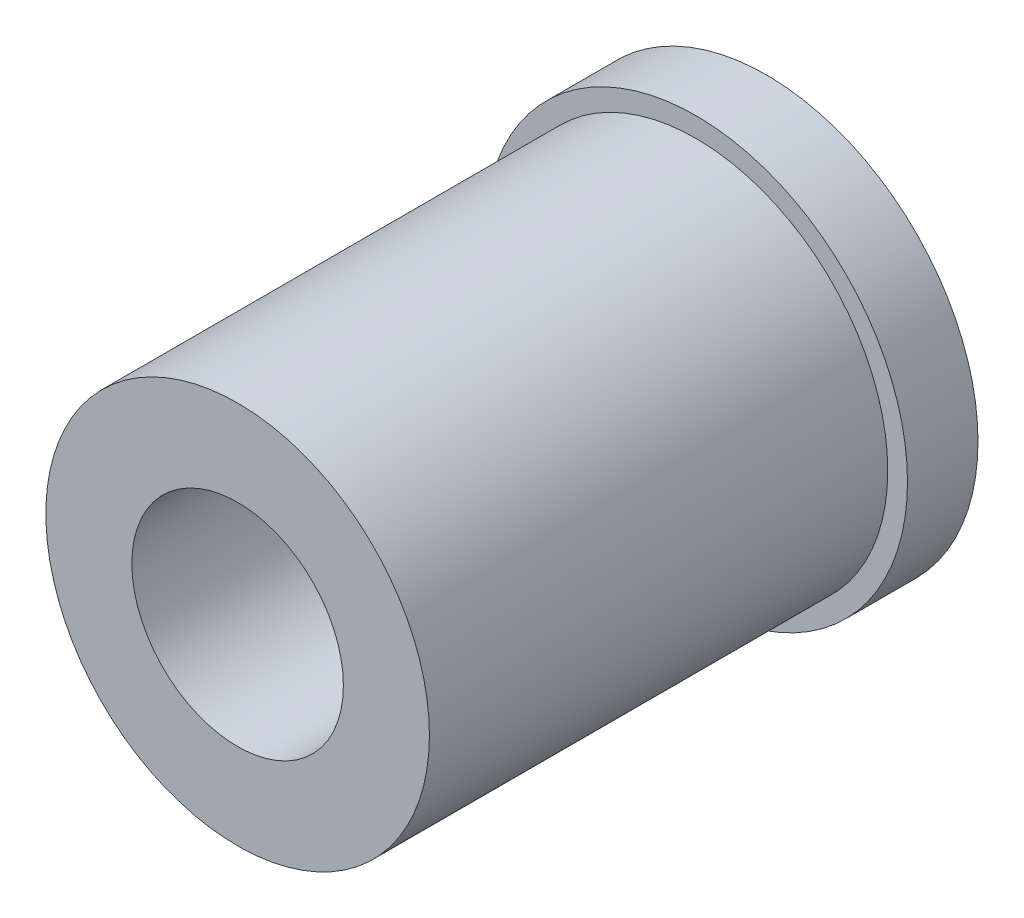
from build123d import *

# Parameters (mm, degrees)
SKETCH2_R           = 9.525
SKETCH2_R_2         = 4.7625
BOSS_EXTRUDE1_DEPTH = 23.8125
CUT_EXTRUDE1_START  = -20.6375
SKETCH3_R           = 9.525
SKETCH3_R_2         = 8.636
CUT_EXTRUDE1_DEPTH  = 20.6375


with BuildPart() as part:
    # Sketch2 → Boss-Extrude1 (new body)
    with BuildSketch(Plane.XY):
        Circle(SKETCH2_R)
        Circle(SKETCH2_R_2, mode=Mode.SUBTRACT)
    extrude(amount=BOSS_EXTRUDE1_DEPTH)

    # Sketch3 → Cut-Extrude1 (cut)
    with BuildSketch(Plane.XY.offset(23.8125).offset(CUT_EXTRUDE1_START)):
        Circle(SKETCH3_R)
        Circle(SKETCH3_R_2, mode=Mode.SUBTRACT)
    extrude(amount=CUT_EXTRUDE1_DEPTH, mode=Mode.SUBTRACT)


solid = part.part
